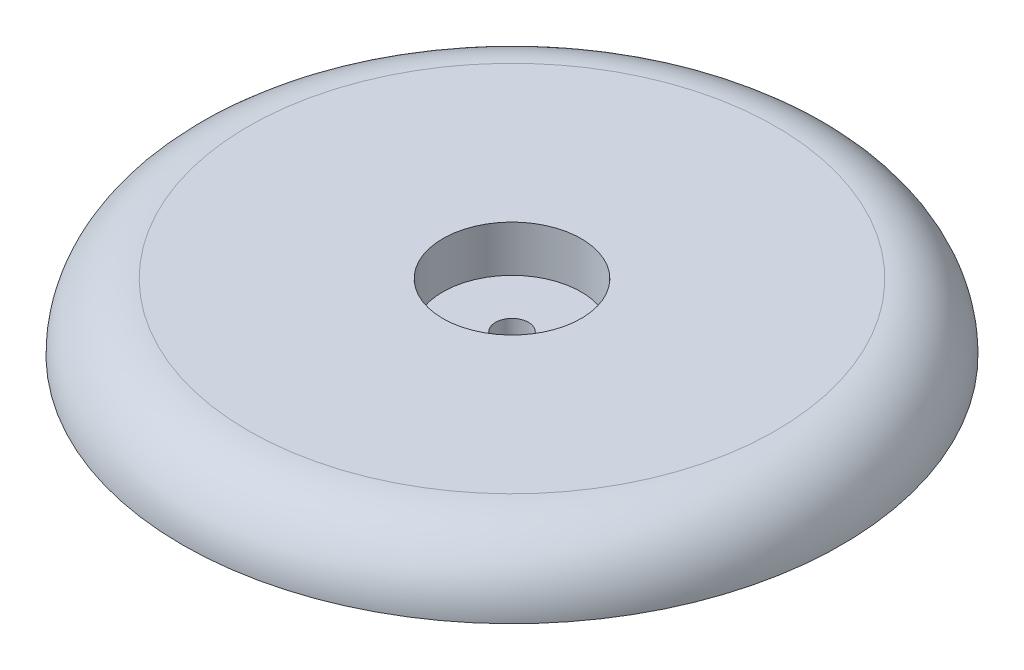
ISO-10303-21;
HEADER;
FILE_DESCRIPTION(('STEP AP214'),'2;1');
FILE_NAME('part.step','',(''),(''),'','','');
FILE_SCHEMA(('AUTOMOTIVE_DESIGN { 1 0 10303 214 1 1 1 1 }'));
ENDSEC;
DATA;
#1=APPLICATION_CONTEXT('core data for automotive mechanical design processes');
#2=APPLICATION_PROTOCOL_DEFINITION('international standard','automotive_design',2000,#1);
#3=PRODUCT_CONTEXT('',#1,'mechanical');
#4=PRODUCT('Part','Part','',(#3));
#5=PRODUCT_RELATED_PRODUCT_CATEGORY('part','',(#4));
#6=PRODUCT_DEFINITION_FORMATION('','',#4);
#7=PRODUCT_DEFINITION_CONTEXT('part definition',#1,'design');
#8=PRODUCT_DEFINITION('design','',#6,#7);
#9=PRODUCT_DEFINITION_SHAPE('','',#8);
#10=(LENGTH_UNIT() NAMED_UNIT(*) SI_UNIT(.MILLI.,.METRE.));
#11=(NAMED_UNIT(*) PLANE_ANGLE_UNIT() SI_UNIT($,.RADIAN.));
#12=(NAMED_UNIT(*) SI_UNIT($,.STERADIAN.) SOLID_ANGLE_UNIT());
#13=UNCERTAINTY_MEASURE_WITH_UNIT(LENGTH_MEASURE(1.E-05),#10,'distance_accuracy_value','');
#14=(GEOMETRIC_REPRESENTATION_CONTEXT(3) GLOBAL_UNCERTAINTY_ASSIGNED_CONTEXT((#13)) GLOBAL_UNIT_ASSIGNED_CONTEXT((#10,
#11,#12)) REPRESENTATION_CONTEXT('',''));
#15=CARTESIAN_POINT('',(0.,0.,0.));
#16=DIRECTION('',(0.,0.,1.));
#17=DIRECTION('',(1.,0.,0.));
#18=AXIS2_PLACEMENT_3D('',#15,#16,#17);
#19=CARTESIAN_POINT('',(0.,10.,0.));
#20=DIRECTION('',(0.,1.,0.));
#21=DIRECTION('',(0.,0.,1.));
#22=AXIS2_PLACEMENT_3D('',#19,#20,#21);
#23=PLANE('',#22);
#24=CARTESIAN_POINT('',(0.,10.,0.));
#25=DIRECTION('',(0.,1.,0.));
#26=DIRECTION('',(0.,0.,1.));
#27=AXIS2_PLACEMENT_3D('',#24,#25,#26);
#28=CIRCLE('',#27,40.);
#29=CARTESIAN_POINT('',(0.,10.,40.));
#30=VERTEX_POINT('',#29);
#31=EDGE_CURVE('E10',#30,#30,#28,.T.);
#32=ORIENTED_EDGE('',*,*,#31,.T.);
#33=EDGE_LOOP('',(#32));
#34=FACE_BOUND('',#33,.T.);
#35=CARTESIAN_POINT('',(0.,10.,0.));
#36=DIRECTION('',(0.,1.,0.));
#37=DIRECTION('',(0.,0.,1.));
#38=AXIS2_PLACEMENT_3D('',#35,#36,#37);
#39=CIRCLE('',#38,10.5);
#40=CARTESIAN_POINT('',(0.,10.,10.5));
#41=VERTEX_POINT('',#40);
#42=EDGE_CURVE('E60',#41,#41,#39,.T.);
#43=ORIENTED_EDGE('',*,*,#42,.F.);
#44=EDGE_LOOP('',(#43));
#45=FACE_BOUND('',#44,.T.);
#46=ADVANCED_FACE('F43',(#34,#45),#23,.T.);
#47=CARTESIAN_POINT('',(0.,0.,0.));
#48=DIRECTION('',(0.,1.,0.));
#49=DIRECTION('',(0.,0.,1.));
#50=AXIS2_PLACEMENT_3D('',#47,#48,#49);
#51=PLANE('',#50);
#52=CARTESIAN_POINT('',(0.,0.,0.));
#53=DIRECTION('',(0.,1.,0.));
#54=DIRECTION('',(0.,0.,1.));
#55=AXIS2_PLACEMENT_3D('',#52,#53,#54);
#56=CIRCLE('',#55,2.5);
#57=CARTESIAN_POINT('',(0.,0.,2.5));
#58=VERTEX_POINT('',#57);
#59=EDGE_CURVE('E47',#58,#58,#56,.T.);
#60=ORIENTED_EDGE('',*,*,#59,.T.);
#61=EDGE_LOOP('',(#60));
#62=FACE_BOUND('',#61,.T.);
#63=CARTESIAN_POINT('',(0.,0.,0.));
#64=DIRECTION('',(0.,1.,0.));
#65=DIRECTION('',(0.,0.,1.));
#66=AXIS2_PLACEMENT_3D('',#63,#64,#65);
#67=CIRCLE('',#66,50.);
#68=CARTESIAN_POINT('',(0.,0.,50.));
#69=VERTEX_POINT('',#68);
#70=EDGE_CURVE('E52',#69,#69,#67,.T.);
#71=ORIENTED_EDGE('',*,*,#70,.F.);
#72=EDGE_LOOP('',(#71));
#73=FACE_BOUND('',#72,.T.);
#74=ADVANCED_FACE('F76',(#62,#73),#51,.F.);
#75=CARTESIAN_POINT('',(0.,3.,0.));
#76=DIRECTION('',(0.,1.,0.));
#77=DIRECTION('',(0.,0.,1.));
#78=AXIS2_PLACEMENT_3D('',#75,#76,#77);
#79=CYLINDRICAL_SURFACE('',#78,10.5);
#80=CARTESIAN_POINT('',(0.,3.,0.));
#81=DIRECTION('',(0.,1.,0.));
#82=DIRECTION('',(0.,0.,1.));
#83=AXIS2_PLACEMENT_3D('',#80,#81,#82);
#84=CIRCLE('',#83,10.5);
#85=CARTESIAN_POINT('',(0.,3.,10.5));
#86=VERTEX_POINT('',#85);
#87=EDGE_CURVE('E57',#86,#86,#84,.T.);
#88=ORIENTED_EDGE('',*,*,#87,.F.);
#89=EDGE_LOOP('',(#88));
#90=FACE_BOUND('',#89,.T.);
#91=ORIENTED_EDGE('',*,*,#42,.T.);
#92=EDGE_LOOP('',(#91));
#93=FACE_BOUND('',#92,.T.);
#94=ADVANCED_FACE('F95',(#90,#93),#79,.F.);
#95=CARTESIAN_POINT('',(0.,3.,0.));
#96=DIRECTION('',(0.,1.,0.));
#97=DIRECTION('',(0.,0.,1.));
#98=AXIS2_PLACEMENT_3D('',#95,#96,#97);
#99=PLANE('',#98);
#100=CARTESIAN_POINT('',(0.,3.,0.));
#101=DIRECTION('',(0.,1.,0.));
#102=DIRECTION('',(0.,0.,1.));
#103=AXIS2_PLACEMENT_3D('',#100,#101,#102);
#104=CIRCLE('',#103,2.5);
#105=CARTESIAN_POINT('',(0.,3.,2.5));
#106=VERTEX_POINT('',#105);
#107=EDGE_CURVE('E67',#106,#106,#104,.T.);
#108=ORIENTED_EDGE('',*,*,#107,.F.);
#109=EDGE_LOOP('',(#108));
#110=FACE_BOUND('',#109,.T.);
#111=ORIENTED_EDGE('',*,*,#87,.T.);
#112=EDGE_LOOP('',(#111));
#113=FACE_BOUND('',#112,.T.);
#114=ADVANCED_FACE('F86',(#110,#113),#99,.T.);
#115=CARTESIAN_POINT('',(0.,0.,0.));
#116=DIRECTION('',(0.,1.,0.));
#117=DIRECTION('',(0.,0.,1.));
#118=AXIS2_PLACEMENT_3D('',#115,#116,#117);
#119=TOROIDAL_SURFACE('',#118,40.,10.);
#120=ORIENTED_EDGE('',*,*,#70,.T.);
#121=EDGE_LOOP('',(#120));
#122=FACE_BOUND('',#121,.T.);
#123=ORIENTED_EDGE('',*,*,#31,.F.);
#124=EDGE_LOOP('',(#123));
#125=FACE_BOUND('',#124,.T.);
#126=ADVANCED_FACE('F45',(#122,#125),#119,.T.);
#127=CARTESIAN_POINT('',(0.,-4.,0.));
#128=DIRECTION('',(0.,1.,0.));
#129=DIRECTION('',(0.,0.,1.));
#130=AXIS2_PLACEMENT_3D('',#127,#128,#129);
#131=CYLINDRICAL_SURFACE('',#130,2.5);
#132=ORIENTED_EDGE('',*,*,#107,.T.);
#133=EDGE_LOOP('',(#132));
#134=FACE_BOUND('',#133,.T.);
#135=ORIENTED_EDGE('',*,*,#59,.F.);
#136=EDGE_LOOP('',(#135));
#137=FACE_BOUND('',#136,.T.);
#138=ADVANCED_FACE('F79',(#134,#137),#131,.F.);
#139=CLOSED_SHELL('',(#46,#74,#94,#114,#126,#138));
#140=MANIFOLD_SOLID_BREP('B2',#139);
#141=ADVANCED_BREP_SHAPE_REPRESENTATION('',(#18,#140),#14);
#142=SHAPE_DEFINITION_REPRESENTATION(#9,#141);
ENDSEC;
END-ISO-10303-21;
